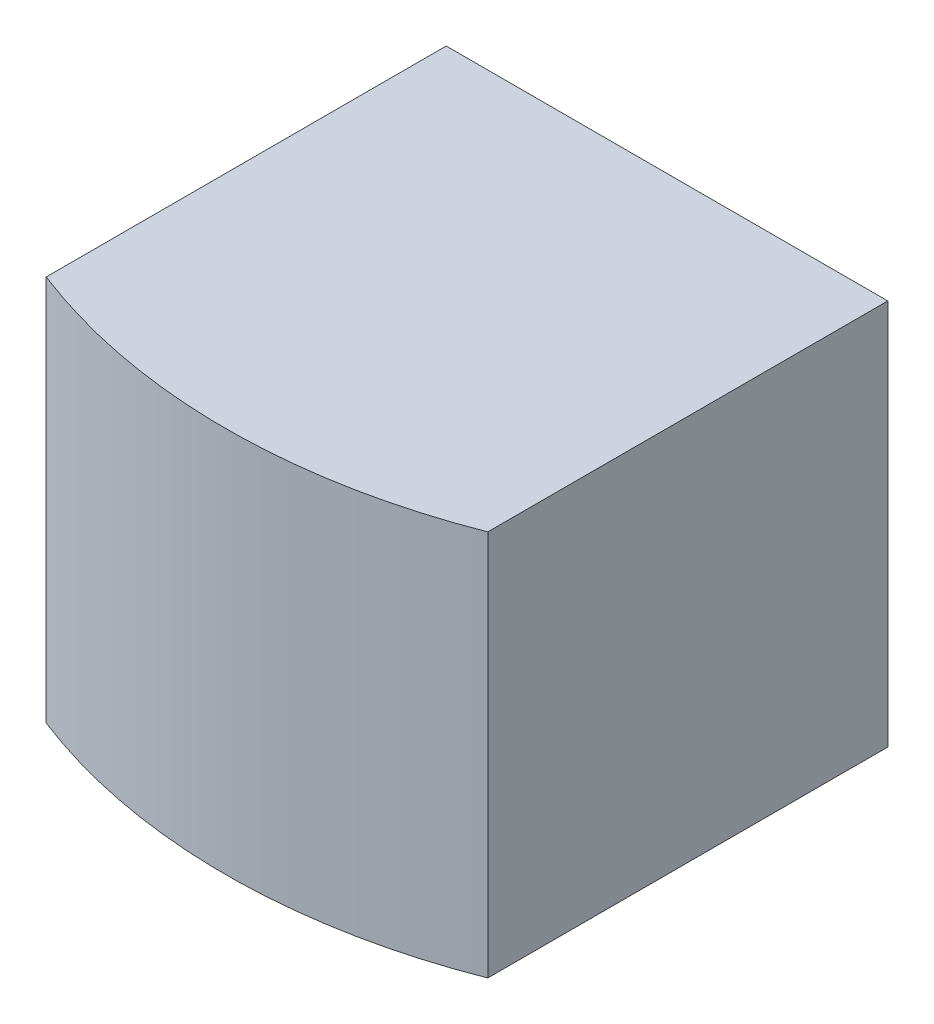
ISO-10303-21;
HEADER;
FILE_DESCRIPTION(('STEP AP214'),'2;1');
FILE_NAME('part.step','',(''),(''),'','','');
FILE_SCHEMA(('AUTOMOTIVE_DESIGN { 1 0 10303 214 1 1 1 1 }'));
ENDSEC;
DATA;
#1=APPLICATION_CONTEXT('core data for automotive mechanical design processes');
#2=APPLICATION_PROTOCOL_DEFINITION('international standard','automotive_design',2000,#1);
#3=PRODUCT_CONTEXT('',#1,'mechanical');
#4=PRODUCT('Part','Part','',(#3));
#5=PRODUCT_RELATED_PRODUCT_CATEGORY('part','',(#4));
#6=PRODUCT_DEFINITION_FORMATION('','',#4);
#7=PRODUCT_DEFINITION_CONTEXT('part definition',#1,'design');
#8=PRODUCT_DEFINITION('design','',#6,#7);
#9=PRODUCT_DEFINITION_SHAPE('','',#8);
#10=(LENGTH_UNIT() NAMED_UNIT(*) SI_UNIT(.MILLI.,.METRE.));
#11=(NAMED_UNIT(*) PLANE_ANGLE_UNIT() SI_UNIT($,.RADIAN.));
#12=(NAMED_UNIT(*) SI_UNIT($,.STERADIAN.) SOLID_ANGLE_UNIT());
#13=UNCERTAINTY_MEASURE_WITH_UNIT(LENGTH_MEASURE(1.E-05),#10,'distance_accuracy_value','');
#14=(GEOMETRIC_REPRESENTATION_CONTEXT(3) GLOBAL_UNCERTAINTY_ASSIGNED_CONTEXT((#13)) GLOBAL_UNIT_ASSIGNED_CONTEXT((#10,
#11,#12)) REPRESENTATION_CONTEXT('',''));
#15=CARTESIAN_POINT('',(0.,0.,0.));
#16=DIRECTION('',(0.,0.,1.));
#17=DIRECTION('',(1.,0.,0.));
#18=AXIS2_PLACEMENT_3D('',#15,#16,#17);
#19=CARTESIAN_POINT('',(-12.7,2.53999999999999,0.));
#20=DIRECTION('',(0.,1.,0.));
#21=DIRECTION('',(0.,0.,1.));
#22=AXIS2_PLACEMENT_3D('',#19,#20,#21);
#23=PLANE('',#22);
#24=DIRECTION('',(0.,0.,-1.));
#25=VECTOR('',#24,1.);
#26=CARTESIAN_POINT('',(50.8,2.53999999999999,50.8));
#27=LINE('',#26,#25);
#28=CARTESIAN_POINT('',(50.8,2.53999999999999,130.136274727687));
#29=VERTEX_POINT('',#28);
#30=CARTESIAN_POINT('',(50.8,2.53999999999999,38.1));
#31=VERTEX_POINT('',#30);
#32=EDGE_CURVE('E74',#29,#31,#27,.T.);
#33=ORIENTED_EDGE('',*,*,#32,.F.);
#34=CARTESIAN_POINT('',(0.,2.53999999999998,0.));
#35=DIRECTION('',(0.,-1.,0.));
#36=DIRECTION('',(0.,0.,-1.));
#37=AXIS2_PLACEMENT_3D('',#34,#35,#36);
#38=CIRCLE('',#37,139.7);
#39=CARTESIAN_POINT('',(-50.8,2.53999999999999,130.136274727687));
#40=VERTEX_POINT('',#39);
#41=EDGE_CURVE('E11',#29,#40,#38,.T.);
#42=ORIENTED_EDGE('',*,*,#41,.T.);
#43=DIRECTION('',(0.,0.,1.));
#44=VECTOR('',#43,1.);
#45=CARTESIAN_POINT('',(-50.8,2.53999999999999,138.447883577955));
#46=LINE('',#45,#44);
#47=CARTESIAN_POINT('',(-50.8,2.53999999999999,38.1));
#48=VERTEX_POINT('',#47);
#49=EDGE_CURVE('E94',#48,#40,#46,.T.);
#50=ORIENTED_EDGE('',*,*,#49,.F.);
#51=DIRECTION('',(-1.,0.,0.));
#52=VECTOR('',#51,1.);
#53=CARTESIAN_POINT('',(-50.8,2.53999999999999,38.1));
#54=LINE('',#53,#52);
#55=EDGE_CURVE('E83',#31,#48,#54,.T.);
#56=ORIENTED_EDGE('',*,*,#55,.F.);
#57=EDGE_LOOP('',(#33,#42,#50,#56));
#58=FACE_BOUND('',#57,.T.);
#59=ADVANCED_FACE('F35',(#58),#23,.F.);
#60=CARTESIAN_POINT('',(0.,0.,0.));
#61=DIRECTION('',(0.,-1.,0.));
#62=DIRECTION('',(0.,0.,-1.));
#63=AXIS2_PLACEMENT_3D('',#60,#61,#62);
#64=CYLINDRICAL_SURFACE('',#63,139.7);
#65=DIRECTION('',(0.,-1.,0.));
#66=VECTOR('',#65,1.);
#67=CARTESIAN_POINT('',(50.8,0.,130.136274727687));
#68=LINE('',#67,#66);
#69=CARTESIAN_POINT('',(50.8,91.44,130.136274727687));
#70=VERTEX_POINT('',#69);
#71=EDGE_CURVE('E79',#70,#29,#68,.T.);
#72=ORIENTED_EDGE('',*,*,#71,.F.);
#73=CARTESIAN_POINT('',(0.,91.44,0.));
#74=DIRECTION('',(0.,-1.,0.));
#75=DIRECTION('',(0.,0.,-1.));
#76=AXIS2_PLACEMENT_3D('',#73,#74,#75);
#77=CIRCLE('',#76,139.7);
#78=CARTESIAN_POINT('',(-50.8,91.44,130.136274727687));
#79=VERTEX_POINT('',#78);
#80=EDGE_CURVE('E42',#70,#79,#77,.T.);
#81=ORIENTED_EDGE('',*,*,#80,.T.);
#82=DIRECTION('',(0.,-1.,0.));
#83=VECTOR('',#82,1.);
#84=CARTESIAN_POINT('',(-50.8,0.,130.136274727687));
#85=LINE('',#84,#83);
#86=EDGE_CURVE('E49',#40,#79,#85,.F.);
#87=ORIENTED_EDGE('',*,*,#86,.F.);
#88=ORIENTED_EDGE('',*,*,#41,.F.);
#89=EDGE_LOOP('',(#72,#81,#87,#88));
#90=FACE_BOUND('',#89,.T.);
#91=ADVANCED_FACE('F106',(#90),#64,.T.);
#92=CARTESIAN_POINT('',(-38.1000000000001,91.44,0.));
#93=DIRECTION('',(0.,-1.,0.));
#94=DIRECTION('',(0.,0.,-1.));
#95=AXIS2_PLACEMENT_3D('',#92,#93,#94);
#96=PLANE('',#95);
#97=DIRECTION('',(0.,0.,-1.));
#98=VECTOR('',#97,1.);
#99=CARTESIAN_POINT('',(50.8,91.44,38.1));
#100=LINE('',#99,#98);
#101=CARTESIAN_POINT('',(50.8,91.44,38.1));
#102=VERTEX_POINT('',#101);
#103=EDGE_CURVE('E57',#70,#102,#100,.T.);
#104=ORIENTED_EDGE('',*,*,#103,.T.);
#105=DIRECTION('',(-1.,0.,0.));
#106=VECTOR('',#105,1.);
#107=CARTESIAN_POINT('',(-50.8,91.44,38.1));
#108=LINE('',#107,#106);
#109=CARTESIAN_POINT('',(-50.8,91.44,38.1));
#110=VERTEX_POINT('',#109);
#111=EDGE_CURVE('E90',#102,#110,#108,.T.);
#112=ORIENTED_EDGE('',*,*,#111,.T.);
#113=DIRECTION('',(0.,0.,1.));
#114=VECTOR('',#113,1.);
#115=CARTESIAN_POINT('',(-50.8,91.44,138.447883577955));
#116=LINE('',#115,#114);
#117=EDGE_CURVE('E84',#110,#79,#116,.T.);
#118=ORIENTED_EDGE('',*,*,#117,.T.);
#119=ORIENTED_EDGE('',*,*,#80,.F.);
#120=EDGE_LOOP('',(#104,#112,#118,#119));
#121=FACE_BOUND('',#120,.T.);
#122=ADVANCED_FACE('F108',(#121),#96,.F.);
#123=CARTESIAN_POINT('',(50.8,2.53999999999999,38.1));
#124=DIRECTION('',(1.,0.,0.));
#125=DIRECTION('',(0.,0.,-1.));
#126=AXIS2_PLACEMENT_3D('',#123,#124,#125);
#127=PLANE('',#126);
#128=ORIENTED_EDGE('',*,*,#71,.T.);
#129=ORIENTED_EDGE('',*,*,#32,.T.);
#130=DIRECTION('',(0.,1.,0.));
#131=VECTOR('',#130,1.);
#132=CARTESIAN_POINT('',(50.8,2.53999999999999,38.1));
#133=LINE('',#132,#131);
#134=EDGE_CURVE('E77',#31,#102,#133,.T.);
#135=ORIENTED_EDGE('',*,*,#134,.T.);
#136=ORIENTED_EDGE('',*,*,#103,.F.);
#137=EDGE_LOOP('',(#128,#129,#135,#136));
#138=FACE_BOUND('',#137,.T.);
#139=ADVANCED_FACE('F76',(#138),#127,.T.);
#140=CARTESIAN_POINT('',(-50.8,2.53999999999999,138.447883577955));
#141=DIRECTION('',(-1.,0.,0.));
#142=DIRECTION('',(0.,0.,1.));
#143=AXIS2_PLACEMENT_3D('',#140,#141,#142);
#144=PLANE('',#143);
#145=ORIENTED_EDGE('',*,*,#86,.T.);
#146=ORIENTED_EDGE('',*,*,#117,.F.);
#147=DIRECTION('',(0.,1.,0.));
#148=VECTOR('',#147,1.);
#149=CARTESIAN_POINT('',(-50.8,2.53999999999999,38.1));
#150=LINE('',#149,#148);
#151=EDGE_CURVE('E91',#48,#110,#150,.T.);
#152=ORIENTED_EDGE('',*,*,#151,.F.);
#153=ORIENTED_EDGE('',*,*,#49,.T.);
#154=EDGE_LOOP('',(#145,#146,#152,#153));
#155=FACE_BOUND('',#154,.T.);
#156=ADVANCED_FACE('F109',(#155),#144,.T.);
#157=CARTESIAN_POINT('',(-50.8,2.53999999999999,38.1));
#158=DIRECTION('',(0.,0.,-1.));
#159=DIRECTION('',(-1.,0.,0.));
#160=AXIS2_PLACEMENT_3D('',#157,#158,#159);
#161=PLANE('',#160);
#162=ORIENTED_EDGE('',*,*,#111,.F.);
#163=ORIENTED_EDGE('',*,*,#134,.F.);
#164=ORIENTED_EDGE('',*,*,#55,.T.);
#165=ORIENTED_EDGE('',*,*,#151,.T.);
#166=EDGE_LOOP('',(#162,#163,#164,#165));
#167=FACE_BOUND('',#166,.T.);
#168=ADVANCED_FACE('F87',(#167),#161,.T.);
#169=CLOSED_SHELL('',(#59,#91,#122,#139,#156,#168));
#170=MANIFOLD_SOLID_BREP('B2',#169);
#171=ADVANCED_BREP_SHAPE_REPRESENTATION('',(#18,#170),#14);
#172=SHAPE_DEFINITION_REPRESENTATION(#9,#171);
ENDSEC;
END-ISO-10303-21;
